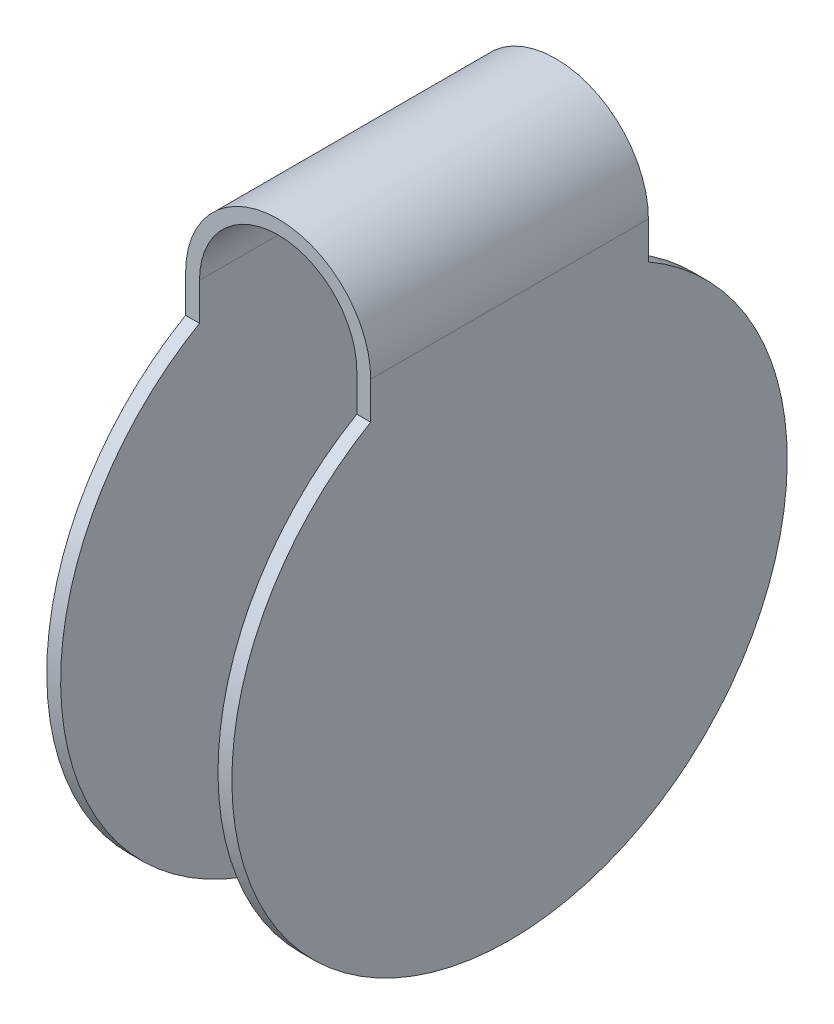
ISO-10303-21;
HEADER;
FILE_DESCRIPTION(('STEP AP214'),'2;1');
FILE_NAME('part.step','',(''),(''),'','','');
FILE_SCHEMA(('AUTOMOTIVE_DESIGN { 1 0 10303 214 1 1 1 1 }'));
ENDSEC;
DATA;
#1=APPLICATION_CONTEXT('core data for automotive mechanical design processes');
#2=APPLICATION_PROTOCOL_DEFINITION('international standard','automotive_design',2000,#1);
#3=PRODUCT_CONTEXT('',#1,'mechanical');
#4=PRODUCT('Part','Part','',(#3));
#5=PRODUCT_RELATED_PRODUCT_CATEGORY('part','',(#4));
#6=PRODUCT_DEFINITION_FORMATION('','',#4);
#7=PRODUCT_DEFINITION_CONTEXT('part definition',#1,'design');
#8=PRODUCT_DEFINITION('design','',#6,#7);
#9=PRODUCT_DEFINITION_SHAPE('','',#8);
#10=(LENGTH_UNIT() NAMED_UNIT(*) SI_UNIT(.MILLI.,.METRE.));
#11=(NAMED_UNIT(*) PLANE_ANGLE_UNIT() SI_UNIT($,.RADIAN.));
#12=(NAMED_UNIT(*) SI_UNIT($,.STERADIAN.) SOLID_ANGLE_UNIT());
#13=UNCERTAINTY_MEASURE_WITH_UNIT(LENGTH_MEASURE(1.E-05),#10,'distance_accuracy_value','');
#14=(GEOMETRIC_REPRESENTATION_CONTEXT(3) GLOBAL_UNCERTAINTY_ASSIGNED_CONTEXT((#13)) GLOBAL_UNIT_ASSIGNED_CONTEXT((#10,
#11,#12)) REPRESENTATION_CONTEXT('',''));
#15=CARTESIAN_POINT('',(0.,0.,0.));
#16=DIRECTION('',(0.,0.,1.));
#17=DIRECTION('',(1.,0.,0.));
#18=AXIS2_PLACEMENT_3D('',#15,#16,#17);
#19=CARTESIAN_POINT('',(10.,60.,60.));
#20=DIRECTION('',(0.,0.,-1.));
#21=DIRECTION('',(-1.,0.,0.));
#22=AXIS2_PLACEMENT_3D('',#19,#20,#21);
#23=CYLINDRICAL_SURFACE('',#22,8.5);
#24=DIRECTION('',(0.,0.,-1.));
#25=VECTOR('',#24,1.);
#26=CARTESIAN_POINT('',(18.5,60.,60.));
#27=LINE('',#26,#25);
#28=CARTESIAN_POINT('',(18.5,60.,45.));
#29=VERTEX_POINT('',#28);
#30=CARTESIAN_POINT('',(18.5,60.,15.));
#31=VERTEX_POINT('',#30);
#32=EDGE_CURVE('E151',#29,#31,#27,.T.);
#33=ORIENTED_EDGE('',*,*,#32,.F.);
#34=CARTESIAN_POINT('',(10.,60.,45.));
#35=DIRECTION('',(0.,0.,-1.));
#36=DIRECTION('',(0.,1.,0.));
#37=AXIS2_PLACEMENT_3D('',#34,#35,#36);
#38=CIRCLE('',#37,8.5);
#39=CARTESIAN_POINT('',(1.5,60.,45.));
#40=VERTEX_POINT('',#39);
#41=EDGE_CURVE('E11',#29,#40,#38,.F.);
#42=ORIENTED_EDGE('',*,*,#41,.T.);
#43=DIRECTION('',(0.,0.,-1.));
#44=VECTOR('',#43,1.);
#45=CARTESIAN_POINT('',(1.5,60.,60.));
#46=LINE('',#45,#44);
#47=CARTESIAN_POINT('',(1.5,60.,15.));
#48=VERTEX_POINT('',#47);
#49=EDGE_CURVE('E154',#40,#48,#46,.T.);
#50=ORIENTED_EDGE('',*,*,#49,.T.);
#51=CARTESIAN_POINT('',(10.,60.,15.));
#52=DIRECTION('',(0.,0.,1.));
#53=DIRECTION('',(0.,-1.,0.));
#54=AXIS2_PLACEMENT_3D('',#51,#52,#53);
#55=CIRCLE('',#54,8.5);
#56=EDGE_CURVE('E43',#48,#31,#55,.F.);
#57=ORIENTED_EDGE('',*,*,#56,.T.);
#58=EDGE_LOOP('',(#33,#42,#50,#57));
#59=FACE_BOUND('',#58,.T.);
#60=ADVANCED_FACE('F35',(#59),#23,.F.);
#61=CARTESIAN_POINT('',(1.5,0.,60.));
#62=DIRECTION('',(-1.,0.,0.));
#63=DIRECTION('',(0.,0.,1.));
#64=AXIS2_PLACEMENT_3D('',#61,#62,#63);
#65=PLANE('',#64);
#66=ORIENTED_EDGE('',*,*,#49,.F.);
#67=DIRECTION('',(0.,-1.,0.));
#68=VECTOR('',#67,1.);
#69=CARTESIAN_POINT('',(1.5,0.,45.));
#70=LINE('',#69,#68);
#71=CARTESIAN_POINT('',(1.5,55.9807621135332,45.));
#72=VERTEX_POINT('',#71);
#73=EDGE_CURVE('E145',#40,#72,#70,.T.);
#74=ORIENTED_EDGE('',*,*,#73,.T.);
#75=CARTESIAN_POINT('',(1.5,30.,30.));
#76=DIRECTION('',(-1.,0.,0.));
#77=DIRECTION('',(0.,0.,1.));
#78=AXIS2_PLACEMENT_3D('',#75,#76,#77);
#79=CIRCLE('',#78,30.);
#80=CARTESIAN_POINT('',(1.5,55.9807621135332,15.));
#81=VERTEX_POINT('',#80);
#82=EDGE_CURVE('E112',#72,#81,#79,.F.);
#83=ORIENTED_EDGE('',*,*,#82,.T.);
#84=DIRECTION('',(0.,1.,0.));
#85=VECTOR('',#84,1.);
#86=CARTESIAN_POINT('',(1.5,0.,15.));
#87=LINE('',#86,#85);
#88=EDGE_CURVE('E138',#81,#48,#87,.T.);
#89=ORIENTED_EDGE('',*,*,#88,.T.);
#90=EDGE_LOOP('',(#66,#74,#83,#89));
#91=FACE_BOUND('',#90,.T.);
#92=ADVANCED_FACE('F179',(#91),#65,.F.);
#93=CARTESIAN_POINT('',(18.5,60.,60.));
#94=DIRECTION('',(1.,0.,0.));
#95=DIRECTION('',(0.,1.,0.));
#96=AXIS2_PLACEMENT_3D('',#93,#94,#95);
#97=PLANE('',#96);
#98=CARTESIAN_POINT('',(18.5,30.,30.));
#99=DIRECTION('',(1.,0.,0.));
#100=DIRECTION('',(0.,1.,0.));
#101=AXIS2_PLACEMENT_3D('',#98,#99,#100);
#102=CIRCLE('',#101,30.);
#103=CARTESIAN_POINT('',(18.5,55.9807621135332,15.));
#104=VERTEX_POINT('',#103);
#105=CARTESIAN_POINT('',(18.5,55.9807621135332,45.));
#106=VERTEX_POINT('',#105);
#107=EDGE_CURVE('E135',#104,#106,#102,.F.);
#108=ORIENTED_EDGE('',*,*,#107,.T.);
#109=DIRECTION('',(0.,1.,0.));
#110=VECTOR('',#109,1.);
#111=CARTESIAN_POINT('',(18.5,60.,45.));
#112=LINE('',#111,#110);
#113=EDGE_CURVE('E147',#106,#29,#112,.T.);
#114=ORIENTED_EDGE('',*,*,#113,.T.);
#115=ORIENTED_EDGE('',*,*,#32,.T.);
#116=DIRECTION('',(0.,-1.,0.));
#117=VECTOR('',#116,1.);
#118=CARTESIAN_POINT('',(18.5,60.,15.));
#119=LINE('',#118,#117);
#120=EDGE_CURVE('E58',#31,#104,#119,.T.);
#121=ORIENTED_EDGE('',*,*,#120,.T.);
#122=EDGE_LOOP('',(#108,#114,#115,#121));
#123=FACE_BOUND('',#122,.T.);
#124=ADVANCED_FACE('F37',(#123),#97,.F.);
#125=CARTESIAN_POINT('',(0.,70.,45.));
#126=DIRECTION('',(0.,0.,-1.));
#127=DIRECTION('',(0.,1.,0.));
#128=AXIS2_PLACEMENT_3D('',#125,#126,#127);
#129=PLANE('',#128);
#130=CARTESIAN_POINT('',(10.,60.,45.));
#131=DIRECTION('',(0.,0.,-1.));
#132=DIRECTION('',(0.,1.,0.));
#133=AXIS2_PLACEMENT_3D('',#130,#131,#132);
#134=CIRCLE('',#133,10.);
#135=CARTESIAN_POINT('',(20.,60.,45.));
#136=VERTEX_POINT('',#135);
#137=CARTESIAN_POINT('',(0.,60.,45.));
#138=VERTEX_POINT('',#137);
#139=EDGE_CURVE('E119',#136,#138,#134,.F.);
#140=ORIENTED_EDGE('',*,*,#139,.T.);
#141=DIRECTION('',(0.,1.,0.));
#142=VECTOR('',#141,1.);
#143=CARTESIAN_POINT('',(0.,70.,45.));
#144=LINE('',#143,#142);
#145=CARTESIAN_POINT('',(0.,55.9807621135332,45.));
#146=VERTEX_POINT('',#145);
#147=EDGE_CURVE('E105',#146,#138,#144,.T.);
#148=ORIENTED_EDGE('',*,*,#147,.F.);
#149=DIRECTION('',(1.,0.,0.));
#150=VECTOR('',#149,1.);
#151=CARTESIAN_POINT('',(0.,55.9807621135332,45.));
#152=LINE('',#151,#150);
#153=EDGE_CURVE('E110',#146,#72,#152,.T.);
#154=ORIENTED_EDGE('',*,*,#153,.T.);
#155=ORIENTED_EDGE('',*,*,#73,.F.);
#156=ORIENTED_EDGE('',*,*,#41,.F.);
#157=ORIENTED_EDGE('',*,*,#113,.F.);
#158=CARTESIAN_POINT('',(20.,55.9807621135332,45.));
#159=VERTEX_POINT('',#158);
#160=EDGE_CURVE('E115',#106,#159,#152,.T.);
#161=ORIENTED_EDGE('',*,*,#160,.T.);
#162=DIRECTION('',(0.,1.,0.));
#163=VECTOR('',#162,1.);
#164=CARTESIAN_POINT('',(20.,70.,45.));
#165=LINE('',#164,#163);
#166=EDGE_CURVE('E133',#159,#136,#165,.T.);
#167=ORIENTED_EDGE('',*,*,#166,.T.);
#168=EDGE_LOOP('',(#140,#148,#154,#155,#156,#157,#161,#167));
#169=FACE_BOUND('',#168,.T.);
#170=ADVANCED_FACE('F117',(#169),#129,.F.);
#171=CARTESIAN_POINT('',(0.,70.,15.));
#172=DIRECTION('',(0.,0.,1.));
#173=DIRECTION('',(0.,-1.,0.));
#174=AXIS2_PLACEMENT_3D('',#171,#172,#173);
#175=PLANE('',#174);
#176=CARTESIAN_POINT('',(10.,60.,15.));
#177=DIRECTION('',(0.,0.,1.));
#178=DIRECTION('',(0.,-1.,0.));
#179=AXIS2_PLACEMENT_3D('',#176,#177,#178);
#180=CIRCLE('',#179,10.);
#181=CARTESIAN_POINT('',(0.,60.,15.));
#182=VERTEX_POINT('',#181);
#183=CARTESIAN_POINT('',(20.,60.,15.));
#184=VERTEX_POINT('',#183);
#185=EDGE_CURVE('E143',#182,#184,#180,.F.);
#186=ORIENTED_EDGE('',*,*,#185,.T.);
#187=DIRECTION('',(0.,-1.,0.));
#188=VECTOR('',#187,1.);
#189=CARTESIAN_POINT('',(20.,70.,15.));
#190=LINE('',#189,#188);
#191=CARTESIAN_POINT('',(20.,55.9807621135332,15.));
#192=VERTEX_POINT('',#191);
#193=EDGE_CURVE('E127',#184,#192,#190,.T.);
#194=ORIENTED_EDGE('',*,*,#193,.T.);
#195=DIRECTION('',(1.,0.,0.));
#196=VECTOR('',#195,1.);
#197=CARTESIAN_POINT('',(0.,55.9807621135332,15.));
#198=LINE('',#197,#196);
#199=EDGE_CURVE('E120',#104,#192,#198,.T.);
#200=ORIENTED_EDGE('',*,*,#199,.F.);
#201=ORIENTED_EDGE('',*,*,#120,.F.);
#202=ORIENTED_EDGE('',*,*,#56,.F.);
#203=ORIENTED_EDGE('',*,*,#88,.F.);
#204=CARTESIAN_POINT('',(0.,55.9807621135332,15.));
#205=VERTEX_POINT('',#204);
#206=EDGE_CURVE('E123',#205,#81,#198,.T.);
#207=ORIENTED_EDGE('',*,*,#206,.F.);
#208=DIRECTION('',(0.,-1.,0.));
#209=VECTOR('',#208,1.);
#210=CARTESIAN_POINT('',(0.,70.,15.));
#211=LINE('',#210,#209);
#212=EDGE_CURVE('E107',#182,#205,#211,.T.);
#213=ORIENTED_EDGE('',*,*,#212,.F.);
#214=EDGE_LOOP('',(#186,#194,#200,#201,#202,#203,#207,#213));
#215=FACE_BOUND('',#214,.T.);
#216=ADVANCED_FACE('F177',(#215),#175,.F.);
#217=CARTESIAN_POINT('',(0.,30.,30.));
#218=DIRECTION('',(1.,0.,0.));
#219=DIRECTION('',(0.,1.,0.));
#220=AXIS2_PLACEMENT_3D('',#217,#218,#219);
#221=CYLINDRICAL_SURFACE('',#220,30.);
#222=ORIENTED_EDGE('',*,*,#82,.F.);
#223=ORIENTED_EDGE('',*,*,#153,.F.);
#224=CARTESIAN_POINT('',(0.,30.,30.));
#225=DIRECTION('',(-1.,0.,0.));
#226=DIRECTION('',(0.,1.,0.));
#227=AXIS2_PLACEMENT_3D('',#224,#225,#226);
#228=CIRCLE('',#227,30.);
#229=EDGE_CURVE('E50',#205,#146,#228,.T.);
#230=ORIENTED_EDGE('',*,*,#229,.F.);
#231=ORIENTED_EDGE('',*,*,#206,.T.);
#232=EDGE_LOOP('',(#222,#223,#230,#231));
#233=FACE_BOUND('',#232,.T.);
#234=ADVANCED_FACE('F111',(#233),#221,.T.);
#235=CARTESIAN_POINT('',(20.,30.,30.));
#236=DIRECTION('',(-1.,0.,0.));
#237=DIRECTION('',(0.,1.,0.));
#238=AXIS2_PLACEMENT_3D('',#235,#236,#237);
#239=CIRCLE('',#238,30.);
#240=EDGE_CURVE('E130',#192,#159,#239,.T.);
#241=ORIENTED_EDGE('',*,*,#240,.T.);
#242=ORIENTED_EDGE('',*,*,#160,.F.);
#243=ORIENTED_EDGE('',*,*,#107,.F.);
#244=ORIENTED_EDGE('',*,*,#199,.T.);
#245=EDGE_LOOP('',(#241,#242,#243,#244));
#246=FACE_BOUND('',#245,.T.);
#247=ADVANCED_FACE('F168',(#246),#221,.T.);
#248=CARTESIAN_POINT('',(0.,0.,60.));
#249=DIRECTION('',(-1.,0.,0.));
#250=DIRECTION('',(0.,0.,1.));
#251=AXIS2_PLACEMENT_3D('',#248,#249,#250);
#252=PLANE('',#251);
#253=ORIENTED_EDGE('',*,*,#147,.T.);
#254=DIRECTION('',(0.,0.,-1.));
#255=VECTOR('',#254,1.);
#256=CARTESIAN_POINT('',(0.,60.,60.));
#257=LINE('',#256,#255);
#258=EDGE_CURVE('E157',#138,#182,#257,.T.);
#259=ORIENTED_EDGE('',*,*,#258,.T.);
#260=ORIENTED_EDGE('',*,*,#212,.T.);
#261=ORIENTED_EDGE('',*,*,#229,.T.);
#262=EDGE_LOOP('',(#253,#259,#260,#261));
#263=FACE_BOUND('',#262,.T.);
#264=ADVANCED_FACE('F102',(#263),#252,.T.);
#265=CARTESIAN_POINT('',(10.,60.,60.));
#266=DIRECTION('',(0.,0.,-1.));
#267=DIRECTION('',(-1.,0.,0.));
#268=AXIS2_PLACEMENT_3D('',#265,#266,#267);
#269=CYLINDRICAL_SURFACE('',#268,10.);
#270=ORIENTED_EDGE('',*,*,#139,.F.);
#271=DIRECTION('',(0.,0.,-1.));
#272=VECTOR('',#271,1.);
#273=CARTESIAN_POINT('',(20.,60.,60.));
#274=LINE('',#273,#272);
#275=EDGE_CURVE('E159',#136,#184,#274,.T.);
#276=ORIENTED_EDGE('',*,*,#275,.T.);
#277=ORIENTED_EDGE('',*,*,#185,.F.);
#278=ORIENTED_EDGE('',*,*,#258,.F.);
#279=EDGE_LOOP('',(#270,#276,#277,#278));
#280=FACE_BOUND('',#279,.T.);
#281=ADVANCED_FACE('F176',(#280),#269,.T.);
#282=CARTESIAN_POINT('',(20.,60.,60.));
#283=DIRECTION('',(1.,0.,0.));
#284=DIRECTION('',(0.,1.,0.));
#285=AXIS2_PLACEMENT_3D('',#282,#283,#284);
#286=PLANE('',#285);
#287=ORIENTED_EDGE('',*,*,#166,.F.);
#288=ORIENTED_EDGE('',*,*,#240,.F.);
#289=ORIENTED_EDGE('',*,*,#193,.F.);
#290=ORIENTED_EDGE('',*,*,#275,.F.);
#291=EDGE_LOOP('',(#287,#288,#289,#290));
#292=FACE_BOUND('',#291,.T.);
#293=ADVANCED_FACE('F173',(#292),#286,.T.);
#294=CLOSED_SHELL('',(#60,#92,#124,#170,#216,#234,#247,#264,#281,#293));
#295=MANIFOLD_SOLID_BREP('B2',#294);
#296=ADVANCED_BREP_SHAPE_REPRESENTATION('',(#18,#295),#14);
#297=SHAPE_DEFINITION_REPRESENTATION(#9,#296);
ENDSEC;
END-ISO-10303-21;
